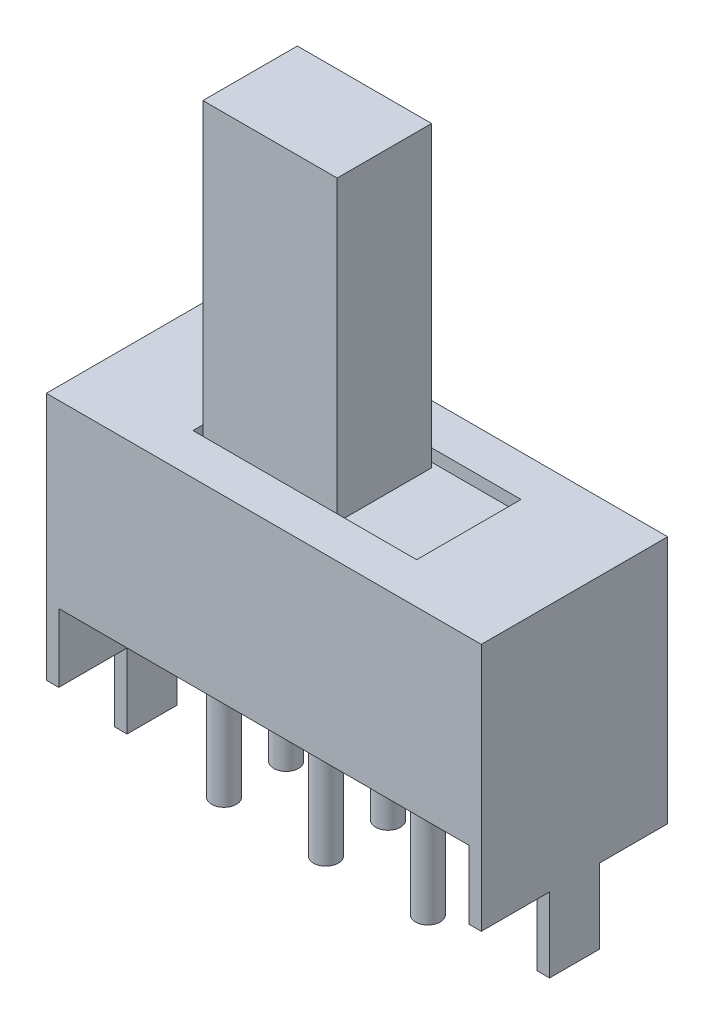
ISO-10303-21;
HEADER;
FILE_DESCRIPTION(('STEP AP214'),'2;1');
FILE_NAME('part.step','',(''),(''),'','','');
FILE_SCHEMA(('AUTOMOTIVE_DESIGN { 1 0 10303 214 1 1 1 1 }'));
ENDSEC;
DATA;
#1=APPLICATION_CONTEXT('core data for automotive mechanical design processes');
#2=APPLICATION_PROTOCOL_DEFINITION('international standard','automotive_design',2000,#1);
#3=PRODUCT_CONTEXT('',#1,'mechanical');
#4=PRODUCT('Part','Part','',(#3));
#5=PRODUCT_RELATED_PRODUCT_CATEGORY('part','',(#4));
#6=PRODUCT_DEFINITION_FORMATION('','',#4);
#7=PRODUCT_DEFINITION_CONTEXT('part definition',#1,'design');
#8=PRODUCT_DEFINITION('design','',#6,#7);
#9=PRODUCT_DEFINITION_SHAPE('','',#8);
#10=(LENGTH_UNIT() NAMED_UNIT(*) SI_UNIT(.MILLI.,.METRE.));
#11=(NAMED_UNIT(*) PLANE_ANGLE_UNIT() SI_UNIT($,.RADIAN.));
#12=(NAMED_UNIT(*) SI_UNIT($,.STERADIAN.) SOLID_ANGLE_UNIT());
#13=UNCERTAINTY_MEASURE_WITH_UNIT(LENGTH_MEASURE(1.E-05),#10,'distance_accuracy_value','');
#14=(GEOMETRIC_REPRESENTATION_CONTEXT(3) GLOBAL_UNCERTAINTY_ASSIGNED_CONTEXT((#13)) GLOBAL_UNIT_ASSIGNED_CONTEXT((#10,
#11,#12)) REPRESENTATION_CONTEXT('',''));
#15=CARTESIAN_POINT('',(0.,0.,0.));
#16=DIRECTION('',(0.,0.,1.));
#17=DIRECTION('',(1.,0.,0.));
#18=AXIS2_PLACEMENT_3D('',#15,#16,#17);
#19=CARTESIAN_POINT('',(-8.25,0.,7.5));
#20=DIRECTION('',(0.,1.,0.));
#21=DIRECTION('',(0.,0.,1.));
#22=AXIS2_PLACEMENT_3D('',#19,#20,#21);
#23=PLANE('',#22);
#24=CARTESIAN_POINT('',(0.,0.,5.));
#25=DIRECTION('',(0.,1.,0.));
#26=DIRECTION('',(0.,0.,1.));
#27=AXIS2_PLACEMENT_3D('',#24,#25,#26);
#28=CIRCLE('',#27,0.5);
#29=CARTESIAN_POINT('',(0.,0.,5.5));
#30=VERTEX_POINT('',#29);
#31=EDGE_CURVE('E39',#30,#30,#28,.F.);
#32=ORIENTED_EDGE('',*,*,#31,.F.);
#33=EDGE_LOOP('',(#32));
#34=FACE_BOUND('',#33,.T.);
#35=CARTESIAN_POINT('',(4.09999999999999,0.,2.5));
#36=DIRECTION('',(0.,1.,0.));
#37=DIRECTION('',(0.,0.,1.));
#38=AXIS2_PLACEMENT_3D('',#35,#36,#37);
#39=CIRCLE('',#38,0.500000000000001);
#40=CARTESIAN_POINT('',(4.09999999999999,0.,3.));
#41=VERTEX_POINT('',#40);
#42=EDGE_CURVE('E333',#41,#41,#39,.F.);
#43=ORIENTED_EDGE('',*,*,#42,.F.);
#44=EDGE_LOOP('',(#43));
#45=FACE_BOUND('',#44,.T.);
#46=CARTESIAN_POINT('',(-4.1,0.,2.5));
#47=DIRECTION('',(0.,1.,0.));
#48=DIRECTION('',(0.,0.,1.));
#49=AXIS2_PLACEMENT_3D('',#46,#47,#48);
#50=CIRCLE('',#49,0.5);
#51=CARTESIAN_POINT('',(-4.1,0.,3.));
#52=VERTEX_POINT('',#51);
#53=EDGE_CURVE('E327',#52,#52,#50,.F.);
#54=ORIENTED_EDGE('',*,*,#53,.F.);
#55=EDGE_LOOP('',(#54));
#56=FACE_BOUND('',#55,.T.);
#57=DIRECTION('',(1.,0.,0.));
#58=VECTOR('',#57,1.);
#59=CARTESIAN_POINT('',(-8.25,0.,0.));
#60=LINE('',#59,#58);
#61=CARTESIAN_POINT('',(-8.25,0.,0.));
#62=VERTEX_POINT('',#61);
#63=CARTESIAN_POINT('',(8.25,0.,0.));
#64=VERTEX_POINT('',#63);
#65=EDGE_CURVE('E307',#62,#64,#60,.T.);
#66=ORIENTED_EDGE('',*,*,#65,.T.);
#67=DIRECTION('',(0.,0.,-1.));
#68=VECTOR('',#67,1.);
#69=CARTESIAN_POINT('',(8.25,0.,7.5));
#70=LINE('',#69,#68);
#71=CARTESIAN_POINT('',(8.25,0.,7.5));
#72=VERTEX_POINT('',#71);
#73=EDGE_CURVE('E310',#72,#64,#70,.T.);
#74=ORIENTED_EDGE('',*,*,#73,.F.);
#75=DIRECTION('',(1.,0.,0.));
#76=VECTOR('',#75,1.);
#77=CARTESIAN_POINT('',(-8.25,0.,7.5));
#78=LINE('',#77,#76);
#79=CARTESIAN_POINT('',(-8.25,0.,7.5));
#80=VERTEX_POINT('',#79);
#81=EDGE_CURVE('E306',#80,#72,#78,.T.);
#82=ORIENTED_EDGE('',*,*,#81,.F.);
#83=DIRECTION('',(0.,0.,-1.));
#84=VECTOR('',#83,1.);
#85=CARTESIAN_POINT('',(-8.25,0.,7.5));
#86=LINE('',#85,#84);
#87=EDGE_CURVE('E317',#80,#62,#86,.T.);
#88=ORIENTED_EDGE('',*,*,#87,.T.);
#89=EDGE_LOOP('',(#66,#74,#82,#88));
#90=FACE_BOUND('',#89,.T.);
#91=CARTESIAN_POINT('',(0.,0.,2.5));
#92=DIRECTION('',(0.,1.,0.));
#93=DIRECTION('',(0.,0.,1.));
#94=AXIS2_PLACEMENT_3D('',#91,#92,#93);
#95=CIRCLE('',#94,0.5);
#96=CARTESIAN_POINT('',(0.,0.,3.));
#97=VERTEX_POINT('',#96);
#98=EDGE_CURVE('E330',#97,#97,#95,.F.);
#99=ORIENTED_EDGE('',*,*,#98,.F.);
#100=EDGE_LOOP('',(#99));
#101=FACE_BOUND('',#100,.T.);
#102=CARTESIAN_POINT('',(-4.1,0.,5.));
#103=DIRECTION('',(0.,1.,0.));
#104=DIRECTION('',(0.,0.,1.));
#105=AXIS2_PLACEMENT_3D('',#102,#103,#104);
#106=CIRCLE('',#105,0.5);
#107=CARTESIAN_POINT('',(-4.1,0.,5.5));
#108=VERTEX_POINT('',#107);
#109=EDGE_CURVE('E336',#108,#108,#106,.F.);
#110=ORIENTED_EDGE('',*,*,#109,.F.);
#111=EDGE_LOOP('',(#110));
#112=FACE_BOUND('',#111,.T.);
#113=CARTESIAN_POINT('',(4.09999999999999,0.,5.));
#114=DIRECTION('',(0.,1.,0.));
#115=DIRECTION('',(0.,0.,1.));
#116=AXIS2_PLACEMENT_3D('',#113,#114,#115);
#117=CIRCLE('',#116,0.500000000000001);
#118=CARTESIAN_POINT('',(4.09999999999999,0.,5.5));
#119=VERTEX_POINT('',#118);
#120=EDGE_CURVE('E11',#119,#119,#117,.F.);
#121=ORIENTED_EDGE('',*,*,#120,.F.);
#122=EDGE_LOOP('',(#121));
#123=FACE_BOUND('',#122,.T.);
#124=ADVANCED_FACE('F32',(#34,#45,#56,#90,#101,#112,#123),#23,.F.);
#125=CARTESIAN_POINT('',(-4.5,6.75,5.85));
#126=DIRECTION('',(0.,1.,0.));
#127=DIRECTION('',(0.,0.,1.));
#128=AXIS2_PLACEMENT_3D('',#125,#126,#127);
#129=PLANE('',#128);
#130=DIRECTION('',(0.,0.,1.));
#131=VECTOR('',#130,1.);
#132=CARTESIAN_POINT('',(-4.5,6.75,1.65));
#133=LINE('',#132,#131);
#134=CARTESIAN_POINT('',(-4.5,6.75,1.65));
#135=VERTEX_POINT('',#134);
#136=CARTESIAN_POINT('',(-4.5,6.75,5.85));
#137=VERTEX_POINT('',#136);
#138=EDGE_CURVE('E244',#135,#137,#133,.T.);
#139=ORIENTED_EDGE('',*,*,#138,.T.);
#140=DIRECTION('',(1.,0.,0.));
#141=VECTOR('',#140,1.);
#142=CARTESIAN_POINT('',(-4.5,6.75,5.85));
#143=LINE('',#142,#141);
#144=CARTESIAN_POINT('',(4.5,6.75,5.85));
#145=VERTEX_POINT('',#144);
#146=EDGE_CURVE('E247',#137,#145,#143,.T.);
#147=ORIENTED_EDGE('',*,*,#146,.T.);
#148=DIRECTION('',(0.,0.,-1.));
#149=VECTOR('',#148,1.);
#150=CARTESIAN_POINT('',(4.5,6.75,1.65));
#151=LINE('',#150,#149);
#152=CARTESIAN_POINT('',(4.5,6.75,1.65));
#153=VERTEX_POINT('',#152);
#154=EDGE_CURVE('E250',#145,#153,#151,.T.);
#155=ORIENTED_EDGE('',*,*,#154,.T.);
#156=DIRECTION('',(-1.,0.,0.));
#157=VECTOR('',#156,1.);
#158=CARTESIAN_POINT('',(-4.5,6.75,1.65));
#159=LINE('',#158,#157);
#160=EDGE_CURVE('E253',#153,#135,#159,.T.);
#161=ORIENTED_EDGE('',*,*,#160,.T.);
#162=EDGE_LOOP('',(#139,#147,#155,#161));
#163=FACE_BOUND('',#162,.T.);
#164=DIRECTION('',(1.,0.,0.));
#165=VECTOR('',#164,1.);
#166=CARTESIAN_POINT('',(-4.3,6.75,5.65));
#167=LINE('',#166,#165);
#168=CARTESIAN_POINT('',(-4.3,6.75,5.65));
#169=VERTEX_POINT('',#168);
#170=CARTESIAN_POINT('',(1.1,6.75,5.65));
#171=VERTEX_POINT('',#170);
#172=EDGE_CURVE('E197',#169,#171,#167,.T.);
#173=ORIENTED_EDGE('',*,*,#172,.F.);
#174=DIRECTION('',(0.,0.,1.));
#175=VECTOR('',#174,1.);
#176=CARTESIAN_POINT('',(-4.3,6.75,1.85));
#177=LINE('',#176,#175);
#178=CARTESIAN_POINT('',(-4.3,6.75,1.85));
#179=VERTEX_POINT('',#178);
#180=EDGE_CURVE('E207',#179,#169,#177,.T.);
#181=ORIENTED_EDGE('',*,*,#180,.F.);
#182=DIRECTION('',(-1.,0.,0.));
#183=VECTOR('',#182,1.);
#184=CARTESIAN_POINT('',(-4.3,6.75,1.85));
#185=LINE('',#184,#183);
#186=CARTESIAN_POINT('',(1.1,6.75,1.85));
#187=VERTEX_POINT('',#186);
#188=EDGE_CURVE('E219',#187,#179,#185,.T.);
#189=ORIENTED_EDGE('',*,*,#188,.F.);
#190=DIRECTION('',(0.,0.,-1.));
#191=VECTOR('',#190,1.);
#192=CARTESIAN_POINT('',(1.1,6.75,1.85));
#193=LINE('',#192,#191);
#194=EDGE_CURVE('E217',#171,#187,#193,.T.);
#195=ORIENTED_EDGE('',*,*,#194,.F.);
#196=EDGE_LOOP('',(#173,#181,#189,#195));
#197=FACE_BOUND('',#196,.T.);
#198=ADVANCED_FACE('F216',(#163,#197),#129,.T.);
#199=CARTESIAN_POINT('',(-8.25,7.25,7.5));
#200=DIRECTION('',(0.,-1.,0.));
#201=DIRECTION('',(0.,0.,-1.));
#202=AXIS2_PLACEMENT_3D('',#199,#200,#201);
#203=PLANE('',#202);
#204=DIRECTION('',(1.,0.,0.));
#205=VECTOR('',#204,1.);
#206=CARTESIAN_POINT('',(-4.5,7.25,5.85));
#207=LINE('',#206,#205);
#208=CARTESIAN_POINT('',(-4.5,7.25,5.85));
#209=VERTEX_POINT('',#208);
#210=CARTESIAN_POINT('',(4.5,7.25,5.85));
#211=VERTEX_POINT('',#210);
#212=EDGE_CURVE('E235',#209,#211,#207,.T.);
#213=ORIENTED_EDGE('',*,*,#212,.F.);
#214=DIRECTION('',(0.,0.,1.));
#215=VECTOR('',#214,1.);
#216=CARTESIAN_POINT('',(-4.5,7.25,1.65));
#217=LINE('',#216,#215);
#218=CARTESIAN_POINT('',(-4.5,7.25,1.65));
#219=VERTEX_POINT('',#218);
#220=EDGE_CURVE('E54',#219,#209,#217,.T.);
#221=ORIENTED_EDGE('',*,*,#220,.F.);
#222=DIRECTION('',(-1.,0.,0.));
#223=VECTOR('',#222,1.);
#224=CARTESIAN_POINT('',(-4.5,7.25,1.65));
#225=LINE('',#224,#223);
#226=CARTESIAN_POINT('',(4.5,7.25,1.65));
#227=VERTEX_POINT('',#226);
#228=EDGE_CURVE('E241',#227,#219,#225,.T.);
#229=ORIENTED_EDGE('',*,*,#228,.F.);
#230=DIRECTION('',(0.,0.,-1.));
#231=VECTOR('',#230,1.);
#232=CARTESIAN_POINT('',(4.5,7.25,1.65));
#233=LINE('',#232,#231);
#234=EDGE_CURVE('E238',#211,#227,#233,.T.);
#235=ORIENTED_EDGE('',*,*,#234,.F.);
#236=EDGE_LOOP('',(#213,#221,#229,#235));
#237=FACE_BOUND('',#236,.T.);
#238=DIRECTION('',(-1.,0.,0.));
#239=VECTOR('',#238,1.);
#240=CARTESIAN_POINT('',(-8.25,7.25,0.));
#241=LINE('',#240,#239);
#242=CARTESIAN_POINT('',(8.75,7.25,0.));
#243=VERTEX_POINT('',#242);
#244=CARTESIAN_POINT('',(-8.75,7.25,0.));
#245=VERTEX_POINT('',#244);
#246=EDGE_CURVE('E304',#243,#245,#241,.T.);
#247=ORIENTED_EDGE('',*,*,#246,.T.);
#248=DIRECTION('',(0.,0.,1.));
#249=VECTOR('',#248,1.);
#250=CARTESIAN_POINT('',(-8.75,7.25,7.5));
#251=LINE('',#250,#249);
#252=CARTESIAN_POINT('',(-8.75,7.25,7.5));
#253=VERTEX_POINT('',#252);
#254=EDGE_CURVE('E516',#245,#253,#251,.T.);
#255=ORIENTED_EDGE('',*,*,#254,.T.);
#256=DIRECTION('',(-1.,0.,0.));
#257=VECTOR('',#256,1.);
#258=CARTESIAN_POINT('',(-8.25,7.25,7.5));
#259=LINE('',#258,#257);
#260=CARTESIAN_POINT('',(8.75,7.25,7.5));
#261=VERTEX_POINT('',#260);
#262=EDGE_CURVE('E308',#261,#253,#259,.T.);
#263=ORIENTED_EDGE('',*,*,#262,.F.);
#264=DIRECTION('',(0.,0.,1.));
#265=VECTOR('',#264,1.);
#266=CARTESIAN_POINT('',(8.75,7.25,7.5));
#267=LINE('',#266,#265);
#268=EDGE_CURVE('E518',#243,#261,#267,.T.);
#269=ORIENTED_EDGE('',*,*,#268,.F.);
#270=EDGE_LOOP('',(#247,#255,#263,#269));
#271=FACE_BOUND('',#270,.T.);
#272=ADVANCED_FACE('F427',(#237,#271),#203,.F.);
#273=CARTESIAN_POINT('',(-8.25,0.,7.5));
#274=DIRECTION('',(0.,0.,1.));
#275=DIRECTION('',(1.,0.,0.));
#276=AXIS2_PLACEMENT_3D('',#273,#274,#275);
#277=PLANE('',#276);
#278=ORIENTED_EDGE('',*,*,#262,.T.);
#279=DIRECTION('',(0.,-1.,0.));
#280=VECTOR('',#279,1.);
#281=CARTESIAN_POINT('',(-8.75,-2.75,7.5));
#282=LINE('',#281,#280);
#283=CARTESIAN_POINT('',(-8.75,-2.75,7.5));
#284=VERTEX_POINT('',#283);
#285=EDGE_CURVE('E527',#253,#284,#282,.T.);
#286=ORIENTED_EDGE('',*,*,#285,.T.);
#287=DIRECTION('',(1.,0.,0.));
#288=VECTOR('',#287,1.);
#289=CARTESIAN_POINT('',(-8.75,-2.75,7.5));
#290=LINE('',#289,#288);
#291=CARTESIAN_POINT('',(-8.25,-2.75,7.5));
#292=VERTEX_POINT('',#291);
#293=EDGE_CURVE('E533',#284,#292,#290,.T.);
#294=ORIENTED_EDGE('',*,*,#293,.T.);
#295=DIRECTION('',(0.,-1.,0.));
#296=VECTOR('',#295,1.);
#297=CARTESIAN_POINT('',(-8.25,-2.75,7.5));
#298=LINE('',#297,#296);
#299=EDGE_CURVE('E279',#80,#292,#298,.T.);
#300=ORIENTED_EDGE('',*,*,#299,.F.);
#301=ORIENTED_EDGE('',*,*,#81,.T.);
#302=DIRECTION('',(0.,-1.,0.));
#303=VECTOR('',#302,1.);
#304=CARTESIAN_POINT('',(8.25,-2.75,7.5));
#305=LINE('',#304,#303);
#306=CARTESIAN_POINT('',(8.25,-2.75,7.5));
#307=VERTEX_POINT('',#306);
#308=EDGE_CURVE('E302',#72,#307,#305,.T.);
#309=ORIENTED_EDGE('',*,*,#308,.T.);
#310=DIRECTION('',(-1.,0.,0.));
#311=VECTOR('',#310,1.);
#312=CARTESIAN_POINT('',(8.75,-2.75,7.5));
#313=LINE('',#312,#311);
#314=CARTESIAN_POINT('',(8.75,-2.75,7.5));
#315=VERTEX_POINT('',#314);
#316=EDGE_CURVE('E597',#315,#307,#313,.T.);
#317=ORIENTED_EDGE('',*,*,#316,.F.);
#318=DIRECTION('',(0.,-1.,0.));
#319=VECTOR('',#318,1.);
#320=CARTESIAN_POINT('',(8.75,-2.75,7.5));
#321=LINE('',#320,#319);
#322=EDGE_CURVE('E568',#261,#315,#321,.T.);
#323=ORIENTED_EDGE('',*,*,#322,.F.);
#324=EDGE_LOOP('',(#278,#286,#294,#300,#301,#309,#317,#323));
#325=FACE_BOUND('',#324,.T.);
#326=ADVANCED_FACE('F502',(#325),#277,.T.);
#327=CARTESIAN_POINT('',(-8.25,0.,0.));
#328=DIRECTION('',(0.,0.,1.));
#329=DIRECTION('',(1.,0.,0.));
#330=AXIS2_PLACEMENT_3D('',#327,#328,#329);
#331=PLANE('',#330);
#332=ORIENTED_EDGE('',*,*,#65,.F.);
#333=DIRECTION('',(0.,1.,0.));
#334=VECTOR('',#333,1.);
#335=CARTESIAN_POINT('',(-8.25,7.25,0.));
#336=LINE('',#335,#334);
#337=CARTESIAN_POINT('',(-8.25,-2.75,0.));
#338=VERTEX_POINT('',#337);
#339=EDGE_CURVE('E287',#338,#62,#336,.T.);
#340=ORIENTED_EDGE('',*,*,#339,.F.);
#341=DIRECTION('',(1.,0.,0.));
#342=VECTOR('',#341,1.);
#343=CARTESIAN_POINT('',(-8.75,-2.75,0.));
#344=LINE('',#343,#342);
#345=CARTESIAN_POINT('',(-8.75,-2.75,0.));
#346=VERTEX_POINT('',#345);
#347=EDGE_CURVE('E530',#346,#338,#344,.T.);
#348=ORIENTED_EDGE('',*,*,#347,.F.);
#349=DIRECTION('',(0.,1.,0.));
#350=VECTOR('',#349,1.);
#351=CARTESIAN_POINT('',(-8.75,7.25,0.));
#352=LINE('',#351,#350);
#353=EDGE_CURVE('E524',#346,#245,#352,.T.);
#354=ORIENTED_EDGE('',*,*,#353,.T.);
#355=ORIENTED_EDGE('',*,*,#246,.F.);
#356=DIRECTION('',(0.,1.,0.));
#357=VECTOR('',#356,1.);
#358=CARTESIAN_POINT('',(8.75,7.25,0.));
#359=LINE('',#358,#357);
#360=CARTESIAN_POINT('',(8.75,-2.75,0.));
#361=VERTEX_POINT('',#360);
#362=EDGE_CURVE('E570',#361,#243,#359,.T.);
#363=ORIENTED_EDGE('',*,*,#362,.F.);
#364=DIRECTION('',(-1.,0.,0.));
#365=VECTOR('',#364,1.);
#366=CARTESIAN_POINT('',(8.75,-2.75,0.));
#367=LINE('',#366,#365);
#368=CARTESIAN_POINT('',(8.25,-2.75,0.));
#369=VERTEX_POINT('',#368);
#370=EDGE_CURVE('E319',#361,#369,#367,.T.);
#371=ORIENTED_EDGE('',*,*,#370,.T.);
#372=DIRECTION('',(0.,1.,0.));
#373=VECTOR('',#372,1.);
#374=CARTESIAN_POINT('',(8.25,7.25,0.));
#375=LINE('',#374,#373);
#376=EDGE_CURVE('E292',#369,#64,#375,.T.);
#377=ORIENTED_EDGE('',*,*,#376,.T.);
#378=EDGE_LOOP('',(#332,#340,#348,#354,#355,#363,#371,#377));
#379=FACE_BOUND('',#378,.T.);
#380=ADVANCED_FACE('F476',(#379),#331,.F.);
#381=CARTESIAN_POINT('',(8.25,-2.75,2.75));
#382=DIRECTION('',(1.,0.,0.));
#383=DIRECTION('',(0.,0.,-1.));
#384=AXIS2_PLACEMENT_3D('',#381,#382,#383);
#385=PLANE('',#384);
#386=ORIENTED_EDGE('',*,*,#308,.F.);
#387=ORIENTED_EDGE('',*,*,#73,.T.);
#388=ORIENTED_EDGE('',*,*,#376,.F.);
#389=DIRECTION('',(0.,0.,-1.));
#390=VECTOR('',#389,1.);
#391=CARTESIAN_POINT('',(8.25,-2.75,0.));
#392=LINE('',#391,#390);
#393=CARTESIAN_POINT('',(8.25,-2.75,2.75));
#394=VERTEX_POINT('',#393);
#395=EDGE_CURVE('E289',#394,#369,#392,.T.);
#396=ORIENTED_EDGE('',*,*,#395,.F.);
#397=DIRECTION('',(0.,1.,0.));
#398=VECTOR('',#397,1.);
#399=CARTESIAN_POINT('',(8.25,-2.75,2.75));
#400=LINE('',#399,#398);
#401=CARTESIAN_POINT('',(8.25,-5.75,2.75));
#402=VERTEX_POINT('',#401);
#403=EDGE_CURVE('E607',#402,#394,#400,.T.);
#404=ORIENTED_EDGE('',*,*,#403,.F.);
#405=DIRECTION('',(0.,0.,-1.));
#406=VECTOR('',#405,1.);
#407=CARTESIAN_POINT('',(8.25,-5.75,2.75));
#408=LINE('',#407,#406);
#409=CARTESIAN_POINT('',(8.25,-5.75,4.75));
#410=VERTEX_POINT('',#409);
#411=EDGE_CURVE('E615',#410,#402,#408,.T.);
#412=ORIENTED_EDGE('',*,*,#411,.F.);
#413=DIRECTION('',(0.,-1.,0.));
#414=VECTOR('',#413,1.);
#415=CARTESIAN_POINT('',(8.25,-5.75,4.75));
#416=LINE('',#415,#414);
#417=CARTESIAN_POINT('',(8.25,-2.75,4.75));
#418=VERTEX_POINT('',#417);
#419=EDGE_CURVE('E614',#418,#410,#416,.T.);
#420=ORIENTED_EDGE('',*,*,#419,.F.);
#421=DIRECTION('',(0.,0.,-1.));
#422=VECTOR('',#421,1.);
#423=CARTESIAN_POINT('',(8.25,-2.75,4.75));
#424=LINE('',#423,#422);
#425=EDGE_CURVE('E611',#307,#418,#424,.T.);
#426=ORIENTED_EDGE('',*,*,#425,.F.);
#427=EDGE_LOOP('',(#386,#387,#388,#396,#404,#412,#420,#426));
#428=FACE_BOUND('',#427,.T.);
#429=ADVANCED_FACE('F472',(#428),#385,.F.);
#430=CARTESIAN_POINT('',(8.75,-2.75,0.));
#431=DIRECTION('',(0.,1.,0.));
#432=DIRECTION('',(0.,0.,1.));
#433=AXIS2_PLACEMENT_3D('',#430,#431,#432);
#434=PLANE('',#433);
#435=ORIENTED_EDGE('',*,*,#395,.T.);
#436=ORIENTED_EDGE('',*,*,#370,.F.);
#437=DIRECTION('',(0.,0.,-1.));
#438=VECTOR('',#437,1.);
#439=CARTESIAN_POINT('',(8.75,-2.75,0.));
#440=LINE('',#439,#438);
#441=CARTESIAN_POINT('',(8.75,-2.75,2.75));
#442=VERTEX_POINT('',#441);
#443=EDGE_CURVE('E574',#442,#361,#440,.T.);
#444=ORIENTED_EDGE('',*,*,#443,.F.);
#445=DIRECTION('',(-1.,0.,0.));
#446=VECTOR('',#445,1.);
#447=CARTESIAN_POINT('',(8.75,-2.75,2.75));
#448=LINE('',#447,#446);
#449=EDGE_CURVE('E585',#442,#394,#448,.T.);
#450=ORIENTED_EDGE('',*,*,#449,.T.);
#451=EDGE_LOOP('',(#435,#436,#444,#450));
#452=FACE_BOUND('',#451,.T.);
#453=ADVANCED_FACE('F475',(#452),#434,.F.);
#454=CARTESIAN_POINT('',(8.75,-2.75,4.75));
#455=DIRECTION('',(0.,1.,0.));
#456=DIRECTION('',(0.,0.,1.));
#457=AXIS2_PLACEMENT_3D('',#454,#455,#456);
#458=PLANE('',#457);
#459=ORIENTED_EDGE('',*,*,#425,.T.);
#460=DIRECTION('',(-1.,0.,0.));
#461=VECTOR('',#460,1.);
#462=CARTESIAN_POINT('',(8.75,-2.75,4.75));
#463=LINE('',#462,#461);
#464=CARTESIAN_POINT('',(8.75,-2.75,4.75));
#465=VERTEX_POINT('',#464);
#466=EDGE_CURVE('E594',#465,#418,#463,.T.);
#467=ORIENTED_EDGE('',*,*,#466,.F.);
#468=DIRECTION('',(0.,0.,-1.));
#469=VECTOR('',#468,1.);
#470=CARTESIAN_POINT('',(8.75,-2.75,4.75));
#471=LINE('',#470,#469);
#472=EDGE_CURVE('E572',#315,#465,#471,.T.);
#473=ORIENTED_EDGE('',*,*,#472,.F.);
#474=ORIENTED_EDGE('',*,*,#316,.T.);
#475=EDGE_LOOP('',(#459,#467,#473,#474));
#476=FACE_BOUND('',#475,.T.);
#477=ADVANCED_FACE('F492',(#476),#458,.F.);
#478=CARTESIAN_POINT('',(8.75,-5.75,4.75));
#479=DIRECTION('',(0.,0.,-1.));
#480=DIRECTION('',(-1.,0.,0.));
#481=AXIS2_PLACEMENT_3D('',#478,#479,#480);
#482=PLANE('',#481);
#483=ORIENTED_EDGE('',*,*,#419,.T.);
#484=DIRECTION('',(-1.,0.,0.));
#485=VECTOR('',#484,1.);
#486=CARTESIAN_POINT('',(8.75,-5.75,4.75));
#487=LINE('',#486,#485);
#488=CARTESIAN_POINT('',(8.75,-5.75,4.75));
#489=VERTEX_POINT('',#488);
#490=EDGE_CURVE('E591',#489,#410,#487,.T.);
#491=ORIENTED_EDGE('',*,*,#490,.F.);
#492=DIRECTION('',(0.,-1.,0.));
#493=VECTOR('',#492,1.);
#494=CARTESIAN_POINT('',(8.75,-5.75,4.75));
#495=LINE('',#494,#493);
#496=EDGE_CURVE('E579',#465,#489,#495,.T.);
#497=ORIENTED_EDGE('',*,*,#496,.F.);
#498=ORIENTED_EDGE('',*,*,#466,.T.);
#499=EDGE_LOOP('',(#483,#491,#497,#498));
#500=FACE_BOUND('',#499,.T.);
#501=ADVANCED_FACE('F488',(#500),#482,.F.);
#502=CARTESIAN_POINT('',(8.75,-5.75,2.75));
#503=DIRECTION('',(0.,1.,0.));
#504=DIRECTION('',(0.,0.,1.));
#505=AXIS2_PLACEMENT_3D('',#502,#503,#504);
#506=PLANE('',#505);
#507=ORIENTED_EDGE('',*,*,#411,.T.);
#508=DIRECTION('',(-1.,0.,0.));
#509=VECTOR('',#508,1.);
#510=CARTESIAN_POINT('',(8.75,-5.75,2.75));
#511=LINE('',#510,#509);
#512=CARTESIAN_POINT('',(8.75,-5.75,2.75));
#513=VERTEX_POINT('',#512);
#514=EDGE_CURVE('E588',#513,#402,#511,.T.);
#515=ORIENTED_EDGE('',*,*,#514,.F.);
#516=DIRECTION('',(0.,0.,-1.));
#517=VECTOR('',#516,1.);
#518=CARTESIAN_POINT('',(8.75,-5.75,2.75));
#519=LINE('',#518,#517);
#520=EDGE_CURVE('E581',#489,#513,#519,.T.);
#521=ORIENTED_EDGE('',*,*,#520,.F.);
#522=ORIENTED_EDGE('',*,*,#490,.T.);
#523=EDGE_LOOP('',(#507,#515,#521,#522));
#524=FACE_BOUND('',#523,.T.);
#525=ADVANCED_FACE('F484',(#524),#506,.F.);
#526=CARTESIAN_POINT('',(8.75,-2.75,2.75));
#527=DIRECTION('',(0.,0.,1.));
#528=DIRECTION('',(1.,0.,0.));
#529=AXIS2_PLACEMENT_3D('',#526,#527,#528);
#530=PLANE('',#529);
#531=ORIENTED_EDGE('',*,*,#403,.T.);
#532=ORIENTED_EDGE('',*,*,#449,.F.);
#533=DIRECTION('',(0.,1.,0.));
#534=VECTOR('',#533,1.);
#535=CARTESIAN_POINT('',(8.75,-2.75,2.75));
#536=LINE('',#535,#534);
#537=EDGE_CURVE('E583',#513,#442,#536,.T.);
#538=ORIENTED_EDGE('',*,*,#537,.F.);
#539=ORIENTED_EDGE('',*,*,#514,.T.);
#540=EDGE_LOOP('',(#531,#532,#538,#539));
#541=FACE_BOUND('',#540,.T.);
#542=ADVANCED_FACE('F480',(#541),#530,.F.);
#543=CARTESIAN_POINT('',(8.75,-2.75,2.75));
#544=DIRECTION('',(1.,0.,0.));
#545=DIRECTION('',(0.,0.,-1.));
#546=AXIS2_PLACEMENT_3D('',#543,#544,#545);
#547=PLANE('',#546);
#548=ORIENTED_EDGE('',*,*,#443,.T.);
#549=ORIENTED_EDGE('',*,*,#362,.T.);
#550=ORIENTED_EDGE('',*,*,#268,.T.);
#551=ORIENTED_EDGE('',*,*,#322,.T.);
#552=ORIENTED_EDGE('',*,*,#472,.T.);
#553=ORIENTED_EDGE('',*,*,#496,.T.);
#554=ORIENTED_EDGE('',*,*,#520,.T.);
#555=ORIENTED_EDGE('',*,*,#537,.T.);
#556=EDGE_LOOP('',(#548,#549,#550,#551,#552,#553,#554,#555));
#557=FACE_BOUND('',#556,.T.);
#558=ADVANCED_FACE('F470',(#557),#547,.T.);
#559=CARTESIAN_POINT('',(-8.75,-2.75,0.));
#560=DIRECTION('',(0.,-1.,0.));
#561=DIRECTION('',(0.,0.,-1.));
#562=AXIS2_PLACEMENT_3D('',#559,#560,#561);
#563=PLANE('',#562);
#564=DIRECTION('',(0.,0.,-1.));
#565=VECTOR('',#564,1.);
#566=CARTESIAN_POINT('',(-8.25,-2.75,0.));
#567=LINE('',#566,#565);
#568=CARTESIAN_POINT('',(-8.25,-2.75,2.75));
#569=VERTEX_POINT('',#568);
#570=EDGE_CURVE('E259',#569,#338,#567,.T.);
#571=ORIENTED_EDGE('',*,*,#570,.F.);
#572=DIRECTION('',(1.,0.,0.));
#573=VECTOR('',#572,1.);
#574=CARTESIAN_POINT('',(-8.75,-2.75,2.75));
#575=LINE('',#574,#573);
#576=CARTESIAN_POINT('',(-8.75,-2.75,2.75));
#577=VERTEX_POINT('',#576);
#578=EDGE_CURVE('E293',#577,#569,#575,.T.);
#579=ORIENTED_EDGE('',*,*,#578,.F.);
#580=DIRECTION('',(0.,0.,-1.));
#581=VECTOR('',#580,1.);
#582=CARTESIAN_POINT('',(-8.75,-2.75,0.));
#583=LINE('',#582,#581);
#584=EDGE_CURVE('E556',#577,#346,#583,.T.);
#585=ORIENTED_EDGE('',*,*,#584,.T.);
#586=ORIENTED_EDGE('',*,*,#347,.T.);
#587=EDGE_LOOP('',(#571,#579,#585,#586));
#588=FACE_BOUND('',#587,.T.);
#589=ADVANCED_FACE('F466',(#588),#563,.T.);
#590=CARTESIAN_POINT('',(-8.75,-2.75,2.75));
#591=DIRECTION('',(0.,0.,-1.));
#592=DIRECTION('',(-1.,0.,0.));
#593=AXIS2_PLACEMENT_3D('',#590,#591,#592);
#594=PLANE('',#593);
#595=DIRECTION('',(0.,1.,0.));
#596=VECTOR('',#595,1.);
#597=CARTESIAN_POINT('',(-8.25,-2.75,2.75));
#598=LINE('',#597,#596);
#599=CARTESIAN_POINT('',(-8.25,-5.75,2.75));
#600=VERTEX_POINT('',#599);
#601=EDGE_CURVE('E267',#600,#569,#598,.T.);
#602=ORIENTED_EDGE('',*,*,#601,.F.);
#603=DIRECTION('',(1.,0.,0.));
#604=VECTOR('',#603,1.);
#605=CARTESIAN_POINT('',(-8.75,-5.75,2.75));
#606=LINE('',#605,#604);
#607=CARTESIAN_POINT('',(-8.75,-5.75,2.75));
#608=VERTEX_POINT('',#607);
#609=EDGE_CURVE('E543',#608,#600,#606,.T.);
#610=ORIENTED_EDGE('',*,*,#609,.F.);
#611=DIRECTION('',(0.,1.,0.));
#612=VECTOR('',#611,1.);
#613=CARTESIAN_POINT('',(-8.75,-2.75,2.75));
#614=LINE('',#613,#612);
#615=EDGE_CURVE('E548',#608,#577,#614,.T.);
#616=ORIENTED_EDGE('',*,*,#615,.T.);
#617=ORIENTED_EDGE('',*,*,#578,.T.);
#618=EDGE_LOOP('',(#602,#610,#616,#617));
#619=FACE_BOUND('',#618,.T.);
#620=ADVANCED_FACE('F462',(#619),#594,.T.);
#621=CARTESIAN_POINT('',(-8.75,-5.75,2.75));
#622=DIRECTION('',(0.,-1.,0.));
#623=DIRECTION('',(0.,0.,-1.));
#624=AXIS2_PLACEMENT_3D('',#621,#622,#623);
#625=PLANE('',#624);
#626=DIRECTION('',(0.,0.,-1.));
#627=VECTOR('',#626,1.);
#628=CARTESIAN_POINT('',(-8.25,-5.75,2.75));
#629=LINE('',#628,#627);
#630=CARTESIAN_POINT('',(-8.25,-5.75,4.75));
#631=VERTEX_POINT('',#630);
#632=EDGE_CURVE('E270',#631,#600,#629,.T.);
#633=ORIENTED_EDGE('',*,*,#632,.F.);
#634=DIRECTION('',(1.,0.,0.));
#635=VECTOR('',#634,1.);
#636=CARTESIAN_POINT('',(-8.75,-5.75,4.75));
#637=LINE('',#636,#635);
#638=CARTESIAN_POINT('',(-8.75,-5.75,4.75));
#639=VERTEX_POINT('',#638);
#640=EDGE_CURVE('E541',#639,#631,#637,.T.);
#641=ORIENTED_EDGE('',*,*,#640,.F.);
#642=DIRECTION('',(0.,0.,-1.));
#643=VECTOR('',#642,1.);
#644=CARTESIAN_POINT('',(-8.75,-5.75,2.75));
#645=LINE('',#644,#643);
#646=EDGE_CURVE('E553',#639,#608,#645,.T.);
#647=ORIENTED_EDGE('',*,*,#646,.T.);
#648=ORIENTED_EDGE('',*,*,#609,.T.);
#649=EDGE_LOOP('',(#633,#641,#647,#648));
#650=FACE_BOUND('',#649,.T.);
#651=ADVANCED_FACE('F458',(#650),#625,.T.);
#652=CARTESIAN_POINT('',(-8.75,-5.75,4.75));
#653=DIRECTION('',(0.,0.,1.));
#654=DIRECTION('',(1.,0.,0.));
#655=AXIS2_PLACEMENT_3D('',#652,#653,#654);
#656=PLANE('',#655);
#657=DIRECTION('',(0.,-1.,0.));
#658=VECTOR('',#657,1.);
#659=CARTESIAN_POINT('',(-8.25,-5.75,4.75));
#660=LINE('',#659,#658);
#661=CARTESIAN_POINT('',(-8.25,-2.75,4.75));
#662=VERTEX_POINT('',#661);
#663=EDGE_CURVE('E273',#662,#631,#660,.T.);
#664=ORIENTED_EDGE('',*,*,#663,.F.);
#665=DIRECTION('',(1.,0.,0.));
#666=VECTOR('',#665,1.);
#667=CARTESIAN_POINT('',(-8.75,-2.75,4.75));
#668=LINE('',#667,#666);
#669=CARTESIAN_POINT('',(-8.75,-2.75,4.75));
#670=VERTEX_POINT('',#669);
#671=EDGE_CURVE('E539',#670,#662,#668,.T.);
#672=ORIENTED_EDGE('',*,*,#671,.F.);
#673=DIRECTION('',(0.,-1.,0.));
#674=VECTOR('',#673,1.);
#675=CARTESIAN_POINT('',(-8.75,-5.75,4.75));
#676=LINE('',#675,#674);
#677=EDGE_CURVE('E558',#670,#639,#676,.T.);
#678=ORIENTED_EDGE('',*,*,#677,.T.);
#679=ORIENTED_EDGE('',*,*,#640,.T.);
#680=EDGE_LOOP('',(#664,#672,#678,#679));
#681=FACE_BOUND('',#680,.T.);
#682=ADVANCED_FACE('F454',(#681),#656,.T.);
#683=CARTESIAN_POINT('',(-8.75,-2.75,4.75));
#684=DIRECTION('',(0.,-1.,0.));
#685=DIRECTION('',(0.,0.,-1.));
#686=AXIS2_PLACEMENT_3D('',#683,#684,#685);
#687=PLANE('',#686);
#688=DIRECTION('',(0.,0.,-1.));
#689=VECTOR('',#688,1.);
#690=CARTESIAN_POINT('',(-8.25,-2.75,4.75));
#691=LINE('',#690,#689);
#692=EDGE_CURVE('E276',#292,#662,#691,.T.);
#693=ORIENTED_EDGE('',*,*,#692,.F.);
#694=ORIENTED_EDGE('',*,*,#293,.F.);
#695=DIRECTION('',(0.,0.,-1.));
#696=VECTOR('',#695,1.);
#697=CARTESIAN_POINT('',(-8.75,-2.75,4.75));
#698=LINE('',#697,#696);
#699=EDGE_CURVE('E562',#284,#670,#698,.T.);
#700=ORIENTED_EDGE('',*,*,#699,.T.);
#701=ORIENTED_EDGE('',*,*,#671,.T.);
#702=EDGE_LOOP('',(#693,#694,#700,#701));
#703=FACE_BOUND('',#702,.T.);
#704=ADVANCED_FACE('F450',(#703),#687,.T.);
#705=CARTESIAN_POINT('',(-8.75,-2.75,2.75));
#706=DIRECTION('',(-1.,0.,0.));
#707=DIRECTION('',(0.,0.,-1.));
#708=AXIS2_PLACEMENT_3D('',#705,#706,#707);
#709=PLANE('',#708);
#710=ORIENTED_EDGE('',*,*,#584,.F.);
#711=ORIENTED_EDGE('',*,*,#615,.F.);
#712=ORIENTED_EDGE('',*,*,#646,.F.);
#713=ORIENTED_EDGE('',*,*,#677,.F.);
#714=ORIENTED_EDGE('',*,*,#699,.F.);
#715=ORIENTED_EDGE('',*,*,#285,.F.);
#716=ORIENTED_EDGE('',*,*,#254,.F.);
#717=ORIENTED_EDGE('',*,*,#353,.F.);
#718=EDGE_LOOP('',(#710,#711,#712,#713,#714,#715,#716,#717));
#719=FACE_BOUND('',#718,.T.);
#720=ADVANCED_FACE('F446',(#719),#709,.T.);
#721=CARTESIAN_POINT('',(-8.25,-2.75,2.75));
#722=DIRECTION('',(-1.,0.,0.));
#723=DIRECTION('',(0.,0.,-1.));
#724=AXIS2_PLACEMENT_3D('',#721,#722,#723);
#725=PLANE('',#724);
#726=ORIENTED_EDGE('',*,*,#87,.F.);
#727=ORIENTED_EDGE('',*,*,#299,.T.);
#728=ORIENTED_EDGE('',*,*,#692,.T.);
#729=ORIENTED_EDGE('',*,*,#663,.T.);
#730=ORIENTED_EDGE('',*,*,#632,.T.);
#731=ORIENTED_EDGE('',*,*,#601,.T.);
#732=ORIENTED_EDGE('',*,*,#570,.T.);
#733=ORIENTED_EDGE('',*,*,#339,.T.);
#734=EDGE_LOOP('',(#726,#727,#728,#729,#730,#731,#732,#733));
#735=FACE_BOUND('',#734,.T.);
#736=ADVANCED_FACE('F443',(#735),#725,.F.);
#737=CARTESIAN_POINT('',(-4.5,6.75,1.65));
#738=DIRECTION('',(-1.,0.,0.));
#739=DIRECTION('',(0.,0.,1.));
#740=AXIS2_PLACEMENT_3D('',#737,#738,#739);
#741=PLANE('',#740);
#742=ORIENTED_EDGE('',*,*,#220,.T.);
#743=DIRECTION('',(0.,1.,0.));
#744=VECTOR('',#743,1.);
#745=CARTESIAN_POINT('',(-4.5,6.75,5.85));
#746=LINE('',#745,#744);
#747=EDGE_CURVE('E256',#137,#209,#746,.T.);
#748=ORIENTED_EDGE('',*,*,#747,.F.);
#749=ORIENTED_EDGE('',*,*,#138,.F.);
#750=DIRECTION('',(0.,1.,0.));
#751=VECTOR('',#750,1.);
#752=CARTESIAN_POINT('',(-4.5,6.75,1.65));
#753=LINE('',#752,#751);
#754=EDGE_CURVE('E257',#135,#219,#753,.T.);
#755=ORIENTED_EDGE('',*,*,#754,.T.);
#756=EDGE_LOOP('',(#742,#748,#749,#755));
#757=FACE_BOUND('',#756,.T.);
#758=ADVANCED_FACE('F433',(#757),#741,.F.);
#759=CARTESIAN_POINT('',(-4.5,6.75,1.65));
#760=DIRECTION('',(0.,0.,-1.));
#761=DIRECTION('',(-1.,0.,0.));
#762=AXIS2_PLACEMENT_3D('',#759,#760,#761);
#763=PLANE('',#762);
#764=ORIENTED_EDGE('',*,*,#228,.T.);
#765=ORIENTED_EDGE('',*,*,#754,.F.);
#766=ORIENTED_EDGE('',*,*,#160,.F.);
#767=DIRECTION('',(0.,1.,0.));
#768=VECTOR('',#767,1.);
#769=CARTESIAN_POINT('',(4.5,6.75,1.65));
#770=LINE('',#769,#768);
#771=EDGE_CURVE('E260',#153,#227,#770,.T.);
#772=ORIENTED_EDGE('',*,*,#771,.T.);
#773=EDGE_LOOP('',(#764,#765,#766,#772));
#774=FACE_BOUND('',#773,.T.);
#775=ADVANCED_FACE('F429',(#774),#763,.F.);
#776=CARTESIAN_POINT('',(4.5,6.75,1.65));
#777=DIRECTION('',(1.,0.,0.));
#778=DIRECTION('',(0.,0.,-1.));
#779=AXIS2_PLACEMENT_3D('',#776,#777,#778);
#780=PLANE('',#779);
#781=ORIENTED_EDGE('',*,*,#234,.T.);
#782=ORIENTED_EDGE('',*,*,#771,.F.);
#783=ORIENTED_EDGE('',*,*,#154,.F.);
#784=DIRECTION('',(0.,1.,0.));
#785=VECTOR('',#784,1.);
#786=CARTESIAN_POINT('',(4.5,6.75,5.85));
#787=LINE('',#786,#785);
#788=EDGE_CURVE('E262',#145,#211,#787,.T.);
#789=ORIENTED_EDGE('',*,*,#788,.T.);
#790=EDGE_LOOP('',(#781,#782,#783,#789));
#791=FACE_BOUND('',#790,.T.);
#792=ADVANCED_FACE('F432',(#791),#780,.F.);
#793=CARTESIAN_POINT('',(-4.5,6.75,5.85));
#794=DIRECTION('',(0.,0.,1.));
#795=DIRECTION('',(1.,0.,0.));
#796=AXIS2_PLACEMENT_3D('',#793,#794,#795);
#797=PLANE('',#796);
#798=ORIENTED_EDGE('',*,*,#212,.T.);
#799=ORIENTED_EDGE('',*,*,#788,.F.);
#800=ORIENTED_EDGE('',*,*,#146,.F.);
#801=ORIENTED_EDGE('',*,*,#747,.T.);
#802=EDGE_LOOP('',(#798,#799,#800,#801));
#803=FACE_BOUND('',#802,.T.);
#804=ADVANCED_FACE('F424',(#803),#797,.F.);
#805=CARTESIAN_POINT('',(-4.3,18.75,1.85));
#806=DIRECTION('',(1.,0.,0.));
#807=DIRECTION('',(0.,0.,-1.));
#808=AXIS2_PLACEMENT_3D('',#805,#806,#807);
#809=PLANE('',#808);
#810=ORIENTED_EDGE('',*,*,#180,.T.);
#811=DIRECTION('',(0.,-1.,0.));
#812=VECTOR('',#811,1.);
#813=CARTESIAN_POINT('',(-4.3,18.75,5.65));
#814=LINE('',#813,#812);
#815=CARTESIAN_POINT('',(-4.3,18.75,5.65));
#816=VERTEX_POINT('',#815);
#817=EDGE_CURVE('E192',#816,#169,#814,.T.);
#818=ORIENTED_EDGE('',*,*,#817,.F.);
#819=DIRECTION('',(0.,0.,1.));
#820=VECTOR('',#819,1.);
#821=CARTESIAN_POINT('',(-4.3,18.75,1.85));
#822=LINE('',#821,#820);
#823=CARTESIAN_POINT('',(-4.3,18.75,1.85));
#824=VERTEX_POINT('',#823);
#825=EDGE_CURVE('E224',#824,#816,#822,.T.);
#826=ORIENTED_EDGE('',*,*,#825,.F.);
#827=DIRECTION('',(0.,-1.,0.));
#828=VECTOR('',#827,1.);
#829=CARTESIAN_POINT('',(-4.3,18.75,1.85));
#830=LINE('',#829,#828);
#831=EDGE_CURVE('E210',#824,#179,#830,.T.);
#832=ORIENTED_EDGE('',*,*,#831,.T.);
#833=EDGE_LOOP('',(#810,#818,#826,#832));
#834=FACE_BOUND('',#833,.T.);
#835=ADVANCED_FACE('F208',(#834),#809,.F.);
#836=CARTESIAN_POINT('',(-4.3,18.75,5.65));
#837=DIRECTION('',(0.,0.,-1.));
#838=DIRECTION('',(-1.,0.,0.));
#839=AXIS2_PLACEMENT_3D('',#836,#837,#838);
#840=PLANE('',#839);
#841=ORIENTED_EDGE('',*,*,#172,.T.);
#842=DIRECTION('',(0.,-1.,0.));
#843=VECTOR('',#842,1.);
#844=CARTESIAN_POINT('',(1.1,18.75,5.65));
#845=LINE('',#844,#843);
#846=CARTESIAN_POINT('',(1.1,18.75,5.65));
#847=VERTEX_POINT('',#846);
#848=EDGE_CURVE('E203',#847,#171,#845,.T.);
#849=ORIENTED_EDGE('',*,*,#848,.F.);
#850=DIRECTION('',(1.,0.,0.));
#851=VECTOR('',#850,1.);
#852=CARTESIAN_POINT('',(-4.3,18.75,5.65));
#853=LINE('',#852,#851);
#854=EDGE_CURVE('E199',#816,#847,#853,.T.);
#855=ORIENTED_EDGE('',*,*,#854,.F.);
#856=ORIENTED_EDGE('',*,*,#817,.T.);
#857=EDGE_LOOP('',(#841,#849,#855,#856));
#858=FACE_BOUND('',#857,.T.);
#859=ADVANCED_FACE('F194',(#858),#840,.F.);
#860=CARTESIAN_POINT('',(1.1,18.75,1.85));
#861=DIRECTION('',(-1.,0.,0.));
#862=DIRECTION('',(0.,0.,1.));
#863=AXIS2_PLACEMENT_3D('',#860,#861,#862);
#864=PLANE('',#863);
#865=ORIENTED_EDGE('',*,*,#194,.T.);
#866=DIRECTION('',(0.,-1.,0.));
#867=VECTOR('',#866,1.);
#868=CARTESIAN_POINT('',(1.1,18.75,1.85));
#869=LINE('',#868,#867);
#870=CARTESIAN_POINT('',(1.1,18.75,1.85));
#871=VERTEX_POINT('',#870);
#872=EDGE_CURVE('E46',#871,#187,#869,.T.);
#873=ORIENTED_EDGE('',*,*,#872,.F.);
#874=DIRECTION('',(0.,0.,-1.));
#875=VECTOR('',#874,1.);
#876=CARTESIAN_POINT('',(1.1,18.75,1.85));
#877=LINE('',#876,#875);
#878=EDGE_CURVE('E227',#847,#871,#877,.T.);
#879=ORIENTED_EDGE('',*,*,#878,.F.);
#880=ORIENTED_EDGE('',*,*,#848,.T.);
#881=EDGE_LOOP('',(#865,#873,#879,#880));
#882=FACE_BOUND('',#881,.T.);
#883=ADVANCED_FACE('F416',(#882),#864,.F.);
#884=CARTESIAN_POINT('',(-4.3,18.75,1.85));
#885=DIRECTION('',(0.,0.,1.));
#886=DIRECTION('',(1.,0.,0.));
#887=AXIS2_PLACEMENT_3D('',#884,#885,#886);
#888=PLANE('',#887);
#889=ORIENTED_EDGE('',*,*,#188,.T.);
#890=ORIENTED_EDGE('',*,*,#831,.F.);
#891=DIRECTION('',(-1.,0.,0.));
#892=VECTOR('',#891,1.);
#893=CARTESIAN_POINT('',(-4.3,18.75,1.85));
#894=LINE('',#893,#892);
#895=EDGE_CURVE('E229',#871,#824,#894,.T.);
#896=ORIENTED_EDGE('',*,*,#895,.F.);
#897=ORIENTED_EDGE('',*,*,#872,.T.);
#898=EDGE_LOOP('',(#889,#890,#896,#897));
#899=FACE_BOUND('',#898,.T.);
#900=ADVANCED_FACE('F412',(#899),#888,.F.);
#901=CARTESIAN_POINT('',(-4.3,18.75,5.65));
#902=DIRECTION('',(0.,1.,0.));
#903=DIRECTION('',(0.,0.,1.));
#904=AXIS2_PLACEMENT_3D('',#901,#902,#903);
#905=PLANE('',#904);
#906=ORIENTED_EDGE('',*,*,#825,.T.);
#907=ORIENTED_EDGE('',*,*,#854,.T.);
#908=ORIENTED_EDGE('',*,*,#878,.T.);
#909=ORIENTED_EDGE('',*,*,#895,.T.);
#910=EDGE_LOOP('',(#906,#907,#908,#909));
#911=FACE_BOUND('',#910,.T.);
#912=ADVANCED_FACE('F408',(#911),#905,.T.);
#913=CARTESIAN_POINT('',(-4.1,-5.75,2.5));
#914=DIRECTION('',(0.,1.,0.));
#915=DIRECTION('',(0.,0.,1.));
#916=AXIS2_PLACEMENT_3D('',#913,#914,#915);
#917=CYLINDRICAL_SURFACE('',#916,0.5);
#918=CARTESIAN_POINT('',(-4.1,-5.75,2.5));
#919=DIRECTION('',(0.,-1.,0.));
#920=DIRECTION('',(0.,0.,-1.));
#921=AXIS2_PLACEMENT_3D('',#918,#919,#920);
#922=CIRCLE('',#921,0.5);
#923=CARTESIAN_POINT('',(-4.1,-5.75,2.));
#924=VERTEX_POINT('',#923);
#925=EDGE_CURVE('E213',#924,#924,#922,.T.);
#926=ORIENTED_EDGE('',*,*,#925,.F.);
#927=EDGE_LOOP('',(#926));
#928=FACE_BOUND('',#927,.T.);
#929=ORIENTED_EDGE('',*,*,#53,.T.);
#930=EDGE_LOOP('',(#929));
#931=FACE_BOUND('',#930,.T.);
#932=ADVANCED_FACE('F404',(#928,#931),#917,.T.);
#933=CARTESIAN_POINT('',(-4.1,-5.75,2.5));
#934=DIRECTION('',(0.,-1.,0.));
#935=DIRECTION('',(0.,0.,-1.));
#936=AXIS2_PLACEMENT_3D('',#933,#934,#935);
#937=PLANE('',#936);
#938=ORIENTED_EDGE('',*,*,#925,.T.);
#939=EDGE_LOOP('',(#938));
#940=FACE_BOUND('',#939,.T.);
#941=ADVANCED_FACE('F400',(#940),#937,.T.);
#942=CARTESIAN_POINT('',(0.,-5.75,2.5));
#943=DIRECTION('',(0.,1.,0.));
#944=DIRECTION('',(0.,0.,1.));
#945=AXIS2_PLACEMENT_3D('',#942,#943,#944);
#946=CYLINDRICAL_SURFACE('',#945,0.5);
#947=CARTESIAN_POINT('',(0.,-5.75,2.5));
#948=DIRECTION('',(0.,-1.,0.));
#949=DIRECTION('',(0.,0.,-1.));
#950=AXIS2_PLACEMENT_3D('',#947,#948,#949);
#951=CIRCLE('',#950,0.5);
#952=CARTESIAN_POINT('',(0.,-5.75,2.));
#953=VERTEX_POINT('',#952);
#954=EDGE_CURVE('E889',#953,#953,#951,.T.);
#955=ORIENTED_EDGE('',*,*,#954,.F.);
#956=EDGE_LOOP('',(#955));
#957=FACE_BOUND('',#956,.T.);
#958=ORIENTED_EDGE('',*,*,#98,.T.);
#959=EDGE_LOOP('',(#958));
#960=FACE_BOUND('',#959,.T.);
#961=ADVANCED_FACE('F396',(#957,#960),#946,.T.);
#962=CARTESIAN_POINT('',(0.,-5.75,2.5));
#963=DIRECTION('',(0.,-1.,0.));
#964=DIRECTION('',(0.,0.,-1.));
#965=AXIS2_PLACEMENT_3D('',#962,#963,#964);
#966=PLANE('',#965);
#967=ORIENTED_EDGE('',*,*,#954,.T.);
#968=EDGE_LOOP('',(#967));
#969=FACE_BOUND('',#968,.T.);
#970=ADVANCED_FACE('F392',(#969),#966,.T.);
#971=CARTESIAN_POINT('',(4.09999999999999,-5.75,2.5));
#972=DIRECTION('',(0.,1.,0.));
#973=DIRECTION('',(0.,0.,1.));
#974=AXIS2_PLACEMENT_3D('',#971,#972,#973);
#975=CYLINDRICAL_SURFACE('',#974,0.500000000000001);
#976=CARTESIAN_POINT('',(4.09999999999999,-5.75,2.5));
#977=DIRECTION('',(0.,-1.,0.));
#978=DIRECTION('',(0.,0.,-1.));
#979=AXIS2_PLACEMENT_3D('',#976,#977,#978);
#980=CIRCLE('',#979,0.500000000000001);
#981=CARTESIAN_POINT('',(4.09999999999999,-5.75,2.));
#982=VERTEX_POINT('',#981);
#983=EDGE_CURVE('E891',#982,#982,#980,.T.);
#984=ORIENTED_EDGE('',*,*,#983,.F.);
#985=EDGE_LOOP('',(#984));
#986=FACE_BOUND('',#985,.T.);
#987=ORIENTED_EDGE('',*,*,#42,.T.);
#988=EDGE_LOOP('',(#987));
#989=FACE_BOUND('',#988,.T.);
#990=ADVANCED_FACE('F388',(#986,#989),#975,.T.);
#991=CARTESIAN_POINT('',(4.09999999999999,-5.75,2.5));
#992=DIRECTION('',(0.,-1.,0.));
#993=DIRECTION('',(0.,0.,-1.));
#994=AXIS2_PLACEMENT_3D('',#991,#992,#993);
#995=PLANE('',#994);
#996=ORIENTED_EDGE('',*,*,#983,.T.);
#997=EDGE_LOOP('',(#996));
#998=FACE_BOUND('',#997,.T.);
#999=ADVANCED_FACE('F384',(#998),#995,.T.);
#1000=CARTESIAN_POINT('',(-4.1,-5.75,5.));
#1001=DIRECTION('',(0.,1.,0.));
#1002=DIRECTION('',(0.,0.,1.));
#1003=AXIS2_PLACEMENT_3D('',#1000,#1001,#1002);
#1004=CYLINDRICAL_SURFACE('',#1003,0.5);
#1005=CARTESIAN_POINT('',(-4.1,-5.75,5.));
#1006=DIRECTION('',(0.,-1.,0.));
#1007=DIRECTION('',(0.,0.,1.));
#1008=AXIS2_PLACEMENT_3D('',#1005,#1006,#1007);
#1009=CIRCLE('',#1008,0.5);
#1010=CARTESIAN_POINT('',(-4.1,-5.75,5.5));
#1011=VERTEX_POINT('',#1010);
#1012=EDGE_CURVE('E896',#1011,#1011,#1009,.T.);
#1013=ORIENTED_EDGE('',*,*,#1012,.F.);
#1014=EDGE_LOOP('',(#1013));
#1015=FACE_BOUND('',#1014,.T.);
#1016=ORIENTED_EDGE('',*,*,#109,.T.);
#1017=EDGE_LOOP('',(#1016));
#1018=FACE_BOUND('',#1017,.T.);
#1019=ADVANCED_FACE('F380',(#1015,#1018),#1004,.T.);
#1020=CARTESIAN_POINT('',(-4.1,-5.75,5.));
#1021=DIRECTION('',(0.,1.,0.));
#1022=DIRECTION('',(0.,0.,1.));
#1023=AXIS2_PLACEMENT_3D('',#1020,#1021,#1022);
#1024=PLANE('',#1023);
#1025=ORIENTED_EDGE('',*,*,#1012,.T.);
#1026=EDGE_LOOP('',(#1025));
#1027=FACE_BOUND('',#1026,.T.);
#1028=ADVANCED_FACE('F376',(#1027),#1024,.F.);
#1029=CARTESIAN_POINT('',(0.,-5.75,5.));
#1030=DIRECTION('',(0.,1.,0.));
#1031=DIRECTION('',(0.,0.,1.));
#1032=AXIS2_PLACEMENT_3D('',#1029,#1030,#1031);
#1033=CYLINDRICAL_SURFACE('',#1032,0.5);
#1034=CARTESIAN_POINT('',(0.,-5.75,5.));
#1035=DIRECTION('',(0.,-1.,0.));
#1036=DIRECTION('',(0.,0.,1.));
#1037=AXIS2_PLACEMENT_3D('',#1034,#1035,#1036);
#1038=CIRCLE('',#1037,0.5);
#1039=CARTESIAN_POINT('',(0.,-5.75,5.5));
#1040=VERTEX_POINT('',#1039);
#1041=EDGE_CURVE('E899',#1040,#1040,#1038,.T.);
#1042=ORIENTED_EDGE('',*,*,#1041,.F.);
#1043=EDGE_LOOP('',(#1042));
#1044=FACE_BOUND('',#1043,.T.);
#1045=ORIENTED_EDGE('',*,*,#31,.T.);
#1046=EDGE_LOOP('',(#1045));
#1047=FACE_BOUND('',#1046,.T.);
#1048=ADVANCED_FACE('F341',(#1044,#1047),#1033,.T.);
#1049=CARTESIAN_POINT('',(0.,-5.75,5.));
#1050=DIRECTION('',(0.,1.,0.));
#1051=DIRECTION('',(0.,0.,1.));
#1052=AXIS2_PLACEMENT_3D('',#1049,#1050,#1051);
#1053=PLANE('',#1052);
#1054=ORIENTED_EDGE('',*,*,#1041,.T.);
#1055=EDGE_LOOP('',(#1054));
#1056=FACE_BOUND('',#1055,.T.);
#1057=ADVANCED_FACE('F361',(#1056),#1053,.F.);
#1058=CARTESIAN_POINT('',(4.09999999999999,-5.75,5.));
#1059=DIRECTION('',(0.,1.,0.));
#1060=DIRECTION('',(0.,0.,1.));
#1061=AXIS2_PLACEMENT_3D('',#1058,#1059,#1060);
#1062=CYLINDRICAL_SURFACE('',#1061,0.500000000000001);
#1063=CARTESIAN_POINT('',(4.09999999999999,-5.75,5.));
#1064=DIRECTION('',(0.,-1.,0.));
#1065=DIRECTION('',(0.,0.,1.));
#1066=AXIS2_PLACEMENT_3D('',#1063,#1064,#1065);
#1067=CIRCLE('',#1066,0.500000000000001);
#1068=CARTESIAN_POINT('',(4.09999999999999,-5.75,5.5));
#1069=VERTEX_POINT('',#1068);
#1070=EDGE_CURVE('E902',#1069,#1069,#1067,.T.);
#1071=ORIENTED_EDGE('',*,*,#1070,.F.);
#1072=EDGE_LOOP('',(#1071));
#1073=FACE_BOUND('',#1072,.T.);
#1074=ORIENTED_EDGE('',*,*,#120,.T.);
#1075=EDGE_LOOP('',(#1074));
#1076=FACE_BOUND('',#1075,.T.);
#1077=ADVANCED_FACE('F358',(#1073,#1076),#1062,.T.);
#1078=CARTESIAN_POINT('',(4.09999999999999,-5.75,5.));
#1079=DIRECTION('',(0.,1.,0.));
#1080=DIRECTION('',(0.,0.,1.));
#1081=AXIS2_PLACEMENT_3D('',#1078,#1079,#1080);
#1082=PLANE('',#1081);
#1083=ORIENTED_EDGE('',*,*,#1070,.T.);
#1084=EDGE_LOOP('',(#1083));
#1085=FACE_BOUND('',#1084,.T.);
#1086=ADVANCED_FACE('F360',(#1085),#1082,.F.);
#1087=CLOSED_SHELL('',(#124,#198,#272,#326,#380,#429,#453,#477,#501,#525,#542,#558,#589,#620,
#651,#682,#704,#720,#736,#758,#775,#792,#804,#835,#859,#883,#900,#912,#932,#941,#961,#970,#990,
#999,#1019,#1028,#1048,#1057,#1077,#1086));
#1088=MANIFOLD_SOLID_BREP('B2',#1087);
#1089=ADVANCED_BREP_SHAPE_REPRESENTATION('',(#18,#1088),#14);
#1090=SHAPE_DEFINITION_REPRESENTATION(#9,#1089);
ENDSEC;
END-ISO-10303-21;
